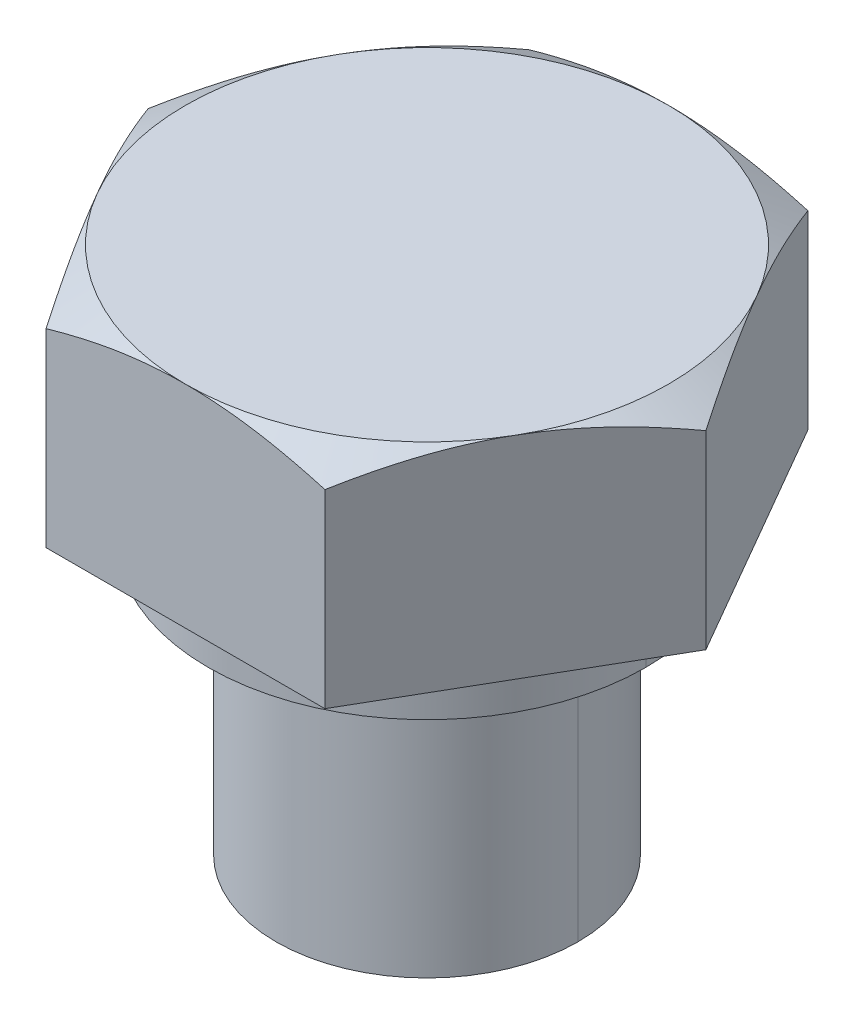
ISO-10303-21;
HEADER;
FILE_DESCRIPTION(('STEP AP214'),'2;1');
FILE_NAME('part.step','',(''),(''),'','','');
FILE_SCHEMA(('AUTOMOTIVE_DESIGN { 1 0 10303 214 1 1 1 1 }'));
ENDSEC;
DATA;
#1=APPLICATION_CONTEXT('core data for automotive mechanical design processes');
#2=APPLICATION_PROTOCOL_DEFINITION('international standard','automotive_design',2000,#1);
#3=PRODUCT_CONTEXT('',#1,'mechanical');
#4=PRODUCT('Part','Part','',(#3));
#5=PRODUCT_RELATED_PRODUCT_CATEGORY('part','',(#4));
#6=PRODUCT_DEFINITION_FORMATION('','',#4);
#7=PRODUCT_DEFINITION_CONTEXT('part definition',#1,'design');
#8=PRODUCT_DEFINITION('design','',#6,#7);
#9=PRODUCT_DEFINITION_SHAPE('','',#8);
#10=(LENGTH_UNIT() NAMED_UNIT(*) SI_UNIT(.MILLI.,.METRE.));
#11=(NAMED_UNIT(*) PLANE_ANGLE_UNIT() SI_UNIT($,.RADIAN.));
#12=(NAMED_UNIT(*) SI_UNIT($,.STERADIAN.) SOLID_ANGLE_UNIT());
#13=UNCERTAINTY_MEASURE_WITH_UNIT(LENGTH_MEASURE(1.E-05),#10,'distance_accuracy_value','');
#14=(GEOMETRIC_REPRESENTATION_CONTEXT(3) GLOBAL_UNCERTAINTY_ASSIGNED_CONTEXT((#13)) GLOBAL_UNIT_ASSIGNED_CONTEXT((#10,
#11,#12)) REPRESENTATION_CONTEXT('',''));
#15=CARTESIAN_POINT('',(0.,0.,0.));
#16=DIRECTION('',(0.,0.,1.));
#17=DIRECTION('',(1.,0.,0.));
#18=AXIS2_PLACEMENT_3D('',#15,#16,#17);
#19=CARTESIAN_POINT('',(-10.,-21.,0.));
#20=DIRECTION('',(0.,1.,0.));
#21=DIRECTION('',(1.,0.,0.));
#22=AXIS2_PLACEMENT_3D('',#19,#20,#21);
#23=PLANE('',#22);
#24=CARTESIAN_POINT('',(0.,-21.,0.));
#25=DIRECTION('',(0.,-1.,0.));
#26=DIRECTION('',(1.,0.,0.));
#27=AXIS2_PLACEMENT_3D('',#24,#25,#26);
#28=CIRCLE('',#27,10.);
#29=CARTESIAN_POINT('',(10.0000000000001,-21.,0.));
#30=VERTEX_POINT('',#29);
#31=CARTESIAN_POINT('',(-10.,-21.,0.));
#32=VERTEX_POINT('',#31);
#33=EDGE_CURVE('E186',#30,#32,#28,.T.);
#34=ORIENTED_EDGE('',*,*,#33,.T.);
#35=CARTESIAN_POINT('',(0.,-21.,0.));
#36=DIRECTION('',(0.,-1.,0.));
#37=DIRECTION('',(1.,0.,0.));
#38=AXIS2_PLACEMENT_3D('',#35,#36,#37);
#39=CIRCLE('',#38,10.);
#40=EDGE_CURVE('E11',#32,#30,#39,.T.);
#41=ORIENTED_EDGE('',*,*,#40,.T.);
#42=EDGE_LOOP('',(#34,#41));
#43=FACE_BOUND('',#42,.T.);
#44=ADVANCED_FACE('F17',(#43),#23,.F.);
#45=CARTESIAN_POINT('',(3.49148133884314E-12,-1000.,0.));
#46=DIRECTION('',(0.,-1.,0.));
#47=DIRECTION('',(1.,0.,0.));
#48=AXIS2_PLACEMENT_3D('',#45,#46,#47);
#49=CYLINDRICAL_SURFACE('',#48,10.);
#50=DIRECTION('',(0.,-1.,0.));
#51=VECTOR('',#50,1.);
#52=CARTESIAN_POINT('',(-9.99999999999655,-1000.,0.));
#53=LINE('',#52,#51);
#54=CARTESIAN_POINT('',(-10.,-4.50000000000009,0.));
#55=VERTEX_POINT('',#54);
#56=EDGE_CURVE('E175',#55,#32,#53,.T.);
#57=ORIENTED_EDGE('',*,*,#56,.F.);
#58=CARTESIAN_POINT('',(0.,-4.50000000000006,0.));
#59=DIRECTION('',(0.,-1.,0.));
#60=DIRECTION('',(1.,0.,0.));
#61=AXIS2_PLACEMENT_3D('',#58,#59,#60);
#62=CIRCLE('',#61,10.);
#63=CARTESIAN_POINT('',(10.,-4.5,0.));
#64=VERTEX_POINT('',#63);
#65=EDGE_CURVE('E28',#55,#64,#62,.T.);
#66=ORIENTED_EDGE('',*,*,#65,.T.);
#67=DIRECTION('',(0.,-1.,0.));
#68=VECTOR('',#67,1.);
#69=CARTESIAN_POINT('',(10.0000000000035,-1000.,0.));
#70=LINE('',#69,#68);
#71=EDGE_CURVE('E172',#64,#30,#70,.T.);
#72=ORIENTED_EDGE('',*,*,#71,.T.);
#73=ORIENTED_EDGE('',*,*,#40,.F.);
#74=EDGE_LOOP('',(#57,#66,#72,#73));
#75=FACE_BOUND('',#74,.T.);
#76=ADVANCED_FACE('F171',(#75),#49,.T.);
#77=CARTESIAN_POINT('',(-8.8,-4.5,0.));
#78=DIRECTION('',(0.,-1.,0.));
#79=DIRECTION('',(0.,0.,-1.));
#80=AXIS2_PLACEMENT_3D('',#77,#78,#79);
#81=PLANE('',#80);
#82=CARTESIAN_POINT('',(0.,-4.50000000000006,0.));
#83=DIRECTION('',(0.,-1.,0.));
#84=DIRECTION('',(1.,0.,0.));
#85=AXIS2_PLACEMENT_3D('',#82,#83,#84);
#86=CIRCLE('',#85,8.8);
#87=CARTESIAN_POINT('',(8.8,-4.5,0.));
#88=VERTEX_POINT('',#87);
#89=CARTESIAN_POINT('',(-8.8,-4.50000000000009,0.));
#90=VERTEX_POINT('',#89);
#91=EDGE_CURVE('E219',#88,#90,#86,.T.);
#92=ORIENTED_EDGE('',*,*,#91,.T.);
#93=CARTESIAN_POINT('',(0.,-4.50000000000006,0.));
#94=DIRECTION('',(0.,-1.,0.));
#95=DIRECTION('',(1.,0.,0.));
#96=AXIS2_PLACEMENT_3D('',#93,#94,#95);
#97=CIRCLE('',#96,8.8);
#98=EDGE_CURVE('E180',#90,#88,#97,.T.);
#99=ORIENTED_EDGE('',*,*,#98,.T.);
#100=EDGE_LOOP('',(#92,#99));
#101=FACE_BOUND('',#100,.T.);
#102=CARTESIAN_POINT('',(0.,-4.50000000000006,0.));
#103=DIRECTION('',(0.,-1.,0.));
#104=DIRECTION('',(1.,0.,0.));
#105=AXIS2_PLACEMENT_3D('',#102,#103,#104);
#106=CIRCLE('',#105,10.);
#107=EDGE_CURVE('E184',#64,#55,#106,.T.);
#108=ORIENTED_EDGE('',*,*,#107,.F.);
#109=ORIENTED_EDGE('',*,*,#65,.F.);
#110=EDGE_LOOP('',(#108,#109));
#111=FACE_BOUND('',#110,.T.);
#112=ADVANCED_FACE('F190',(#101,#111),#81,.F.);
#113=CARTESIAN_POINT('',(3.49148133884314E-12,-1000.,0.));
#114=DIRECTION('',(0.,-1.,0.));
#115=DIRECTION('',(1.,0.,0.));
#116=AXIS2_PLACEMENT_3D('',#113,#114,#115);
#117=CYLINDRICAL_SURFACE('',#116,8.8);
#118=DIRECTION('',(0.,-1.,0.));
#119=VECTOR('',#118,1.);
#120=CARTESIAN_POINT('',(-8.79999999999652,-1000.,0.));
#121=LINE('',#120,#119);
#122=CARTESIAN_POINT('',(-8.8,-3.00000000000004,0.));
#123=VERTEX_POINT('',#122);
#124=EDGE_CURVE('E211',#123,#90,#121,.T.);
#125=ORIENTED_EDGE('',*,*,#124,.F.);
#126=CARTESIAN_POINT('',(0.,-3.,0.));
#127=DIRECTION('',(0.,-1.,0.));
#128=DIRECTION('',(1.,0.,0.));
#129=AXIS2_PLACEMENT_3D('',#126,#127,#128);
#130=CIRCLE('',#129,8.8);
#131=CARTESIAN_POINT('',(8.8,-3.,0.));
#132=VERTEX_POINT('',#131);
#133=EDGE_CURVE('E228',#123,#132,#130,.T.);
#134=ORIENTED_EDGE('',*,*,#133,.T.);
#135=DIRECTION('',(0.,-1.,0.));
#136=VECTOR('',#135,1.);
#137=CARTESIAN_POINT('',(8.80000000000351,-1000.,0.));
#138=LINE('',#137,#136);
#139=EDGE_CURVE('E223',#132,#88,#138,.T.);
#140=ORIENTED_EDGE('',*,*,#139,.T.);
#141=ORIENTED_EDGE('',*,*,#98,.F.);
#142=EDGE_LOOP('',(#125,#134,#140,#141));
#143=FACE_BOUND('',#142,.T.);
#144=ADVANCED_FACE('F955',(#143),#117,.T.);
#145=CARTESIAN_POINT('',(-14.5,-3.,0.));
#146=DIRECTION('',(0.,1.,0.));
#147=DIRECTION('',(1.,0.,0.));
#148=AXIS2_PLACEMENT_3D('',#145,#146,#147);
#149=PLANE('',#148);
#150=CARTESIAN_POINT('',(0.,-3.,0.));
#151=DIRECTION('',(0.,-1.,0.));
#152=DIRECTION('',(1.,0.,0.));
#153=AXIS2_PLACEMENT_3D('',#150,#151,#152);
#154=CIRCLE('',#153,8.8);
#155=EDGE_CURVE('E188',#132,#123,#154,.T.);
#156=ORIENTED_EDGE('',*,*,#155,.F.);
#157=ORIENTED_EDGE('',*,*,#133,.F.);
#158=EDGE_LOOP('',(#156,#157));
#159=FACE_BOUND('',#158,.T.);
#160=CARTESIAN_POINT('',(0.,-3.,0.));
#161=DIRECTION('',(0.,-1.,0.));
#162=DIRECTION('',(1.,0.,0.));
#163=AXIS2_PLACEMENT_3D('',#160,#161,#162);
#164=CIRCLE('',#163,14.5);
#165=CARTESIAN_POINT('',(14.5,-2.99999999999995,0.));
#166=VERTEX_POINT('',#165);
#167=CARTESIAN_POINT('',(-14.5,-3.00000000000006,0.));
#168=VERTEX_POINT('',#167);
#169=EDGE_CURVE('E200',#166,#168,#164,.T.);
#170=ORIENTED_EDGE('',*,*,#169,.T.);
#171=CARTESIAN_POINT('',(0.,-3.,0.));
#172=DIRECTION('',(0.,-1.,0.));
#173=DIRECTION('',(1.,0.,0.));
#174=AXIS2_PLACEMENT_3D('',#171,#172,#173);
#175=CIRCLE('',#174,14.5);
#176=EDGE_CURVE('E231',#168,#166,#175,.T.);
#177=ORIENTED_EDGE('',*,*,#176,.T.);
#178=EDGE_LOOP('',(#170,#177));
#179=FACE_BOUND('',#178,.T.);
#180=ADVANCED_FACE('F947',(#159,#179),#149,.F.);
#181=CARTESIAN_POINT('',(3.49148133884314E-12,-1000.,0.));
#182=DIRECTION('',(0.,-1.,0.));
#183=DIRECTION('',(1.,0.,0.));
#184=AXIS2_PLACEMENT_3D('',#181,#182,#183);
#185=CYLINDRICAL_SURFACE('',#184,14.5);
#186=DIRECTION('',(0.,-1.,0.));
#187=VECTOR('',#186,1.);
#188=CARTESIAN_POINT('',(-14.4999999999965,-1000.,0.));
#189=LINE('',#188,#187);
#190=CARTESIAN_POINT('',(-14.5,0.,0.));
#191=VERTEX_POINT('',#190);
#192=EDGE_CURVE('E204',#191,#168,#189,.T.);
#193=ORIENTED_EDGE('',*,*,#192,.F.);
#194=CARTESIAN_POINT('',(0.,0.,0.));
#195=DIRECTION('',(0.,-1.,0.));
#196=DIRECTION('',(0.,0.,1.));
#197=AXIS2_PLACEMENT_3D('',#194,#195,#196);
#198=CIRCLE('',#197,14.5);
#199=CARTESIAN_POINT('',(14.5,0.,0.));
#200=VERTEX_POINT('',#199);
#201=EDGE_CURVE('E268',#191,#200,#198,.T.);
#202=ORIENTED_EDGE('',*,*,#201,.T.);
#203=DIRECTION('',(0.,-1.,0.));
#204=VECTOR('',#203,1.);
#205=CARTESIAN_POINT('',(14.5000000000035,-1000.,0.));
#206=LINE('',#205,#204);
#207=EDGE_CURVE('E203',#200,#166,#206,.T.);
#208=ORIENTED_EDGE('',*,*,#207,.T.);
#209=ORIENTED_EDGE('',*,*,#176,.F.);
#210=EDGE_LOOP('',(#193,#202,#208,#209));
#211=FACE_BOUND('',#210,.T.);
#212=ADVANCED_FACE('F940',(#211),#185,.T.);
#213=CARTESIAN_POINT('',(0.,14.,0.));
#214=DIRECTION('',(0.,1.,0.));
#215=DIRECTION('',(1.,0.,0.));
#216=AXIS2_PLACEMENT_3D('',#213,#214,#215);
#217=PLANE('',#216);
#218=CARTESIAN_POINT('',(0.,14.,0.));
#219=DIRECTION('',(0.,1.,0.));
#220=DIRECTION('',(0.,0.,1.));
#221=AXIS2_PLACEMENT_3D('',#218,#219,#220);
#222=CIRCLE('',#221,16.);
#223=CARTESIAN_POINT('',(0.,14.,-16.));
#224=VERTEX_POINT('',#223);
#225=CARTESIAN_POINT('',(-13.856406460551,14.,-8.));
#226=VERTEX_POINT('',#225);
#227=EDGE_CURVE('E404',#224,#226,#222,.T.);
#228=ORIENTED_EDGE('',*,*,#227,.T.);
#229=CARTESIAN_POINT('',(0.,14.,0.));
#230=DIRECTION('',(0.,1.,0.));
#231=DIRECTION('',(0.,0.,1.));
#232=AXIS2_PLACEMENT_3D('',#229,#230,#231);
#233=CIRCLE('',#232,16.);
#234=CARTESIAN_POINT('',(-13.856406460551,14.,8.));
#235=VERTEX_POINT('',#234);
#236=EDGE_CURVE('E252',#226,#235,#233,.T.);
#237=ORIENTED_EDGE('',*,*,#236,.T.);
#238=CARTESIAN_POINT('',(0.,14.,0.));
#239=DIRECTION('',(0.,1.,0.));
#240=DIRECTION('',(0.,0.,1.));
#241=AXIS2_PLACEMENT_3D('',#238,#239,#240);
#242=CIRCLE('',#241,16.);
#243=CARTESIAN_POINT('',(0.,14.,16.));
#244=VERTEX_POINT('',#243);
#245=EDGE_CURVE('E511',#235,#244,#242,.T.);
#246=ORIENTED_EDGE('',*,*,#245,.T.);
#247=CARTESIAN_POINT('',(0.,14.,0.));
#248=DIRECTION('',(0.,1.,0.));
#249=DIRECTION('',(0.,0.,1.));
#250=AXIS2_PLACEMENT_3D('',#247,#248,#249);
#251=CIRCLE('',#250,16.);
#252=CARTESIAN_POINT('',(13.856406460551,14.,8.));
#253=VERTEX_POINT('',#252);
#254=EDGE_CURVE('E271',#244,#253,#251,.T.);
#255=ORIENTED_EDGE('',*,*,#254,.T.);
#256=CARTESIAN_POINT('',(0.,14.,0.));
#257=DIRECTION('',(0.,1.,0.));
#258=DIRECTION('',(0.,0.,1.));
#259=AXIS2_PLACEMENT_3D('',#256,#257,#258);
#260=CIRCLE('',#259,16.);
#261=CARTESIAN_POINT('',(13.856406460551,14.,-8.));
#262=VERTEX_POINT('',#261);
#263=EDGE_CURVE('E42',#253,#262,#260,.T.);
#264=ORIENTED_EDGE('',*,*,#263,.T.);
#265=CARTESIAN_POINT('',(0.,14.,0.));
#266=DIRECTION('',(0.,1.,0.));
#267=DIRECTION('',(0.,0.,1.));
#268=AXIS2_PLACEMENT_3D('',#265,#266,#267);
#269=CIRCLE('',#268,16.);
#270=EDGE_CURVE('E413',#262,#224,#269,.T.);
#271=ORIENTED_EDGE('',*,*,#270,.T.);
#272=EDGE_LOOP('',(#228,#237,#246,#255,#264,#271));
#273=FACE_BOUND('',#272,.T.);
#274=ADVANCED_FACE('F325',(#273),#217,.T.);
#275=CARTESIAN_POINT('',(0.,14.,0.));
#276=DIRECTION('',(0.,-1.,0.));
#277=DIRECTION('',(0.,0.,1.));
#278=AXIS2_PLACEMENT_3D('',#275,#276,#277);
#279=CONICAL_SURFACE('',#278,16.,1.0471975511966);
#280=CARTESIAN_POINT('',(-18.475208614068,12.5709376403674,0.));
#281=CARTESIAN_POINT('',(-17.2736739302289,13.2646440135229,-2.08111911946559));
#282=CARTESIAN_POINT('',(-16.1894881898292,13.6151811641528,-3.95898390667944));
#283=CARTESIAN_POINT('',(-14.999271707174,14.,-6.02049932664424));
#284=CARTESIAN_POINT('',(-13.856406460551,14.,-7.99999999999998));
#285=B_SPLINE_CURVE_WITH_KNOTS('',2,(#280,#281,#282,#283,#284),.UNSPECIFIED.,.F.,.F.,(3,2,3),
(0.,0.5,1.),.UNSPECIFIED.);
#286=CARTESIAN_POINT('',(-18.475208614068,12.5709376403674,0.));
#287=VERTEX_POINT('',#286);
#288=EDGE_CURVE('E419',#287,#226,#285,.T.);
#289=ORIENTED_EDGE('',*,*,#288,.F.);
#290=CARTESIAN_POINT('',(-13.856406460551,14.,8.));
#291=CARTESIAN_POINT('',(-14.4407214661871,14.,6.98793672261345));
#292=CARTESIAN_POINT('',(-15.0315803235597,13.9008644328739,5.96453916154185));
#293=CARTESIAN_POINT('',(-15.602960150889,13.8049970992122,4.9748802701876));
#294=CARTESIAN_POINT('',(-16.1924322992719,13.614228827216,3.95388455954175));
#295=CARTESIAN_POINT('',(-17.2749849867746,13.2638870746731,2.0788483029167));
#296=CARTESIAN_POINT('',(-18.475208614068,12.5709376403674,0.));
#297=B_SPLINE_CURVE_WITH_KNOTS('',2,(#290,#291,#292,#293,#294,#295,#296),.UNSPECIFIED.,.F.,.F.,
(3,2,2,3),(0.,0.25,0.5,1.),.UNSPECIFIED.);
#298=EDGE_CURVE('E258',#235,#287,#297,.T.);
#299=ORIENTED_EDGE('',*,*,#298,.F.);
#300=ORIENTED_EDGE('',*,*,#236,.F.);
#301=EDGE_LOOP('',(#289,#299,#300));
#302=FACE_BOUND('',#301,.T.);
#303=ADVANCED_FACE('F392',(#302),#279,.T.);
#304=CARTESIAN_POINT('',(0.,14.,0.));
#305=DIRECTION('',(0.,-1.,0.));
#306=DIRECTION('',(0.,0.,1.));
#307=AXIS2_PLACEMENT_3D('',#304,#305,#306);
#308=CONICAL_SURFACE('',#307,16.,1.0471975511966);
#309=CARTESIAN_POINT('',(-13.856406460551,14.,-7.99999999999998));
#310=CARTESIAN_POINT('',(-13.2720914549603,14.,-9.01206327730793));
#311=CARTESIAN_POINT('',(-12.6812325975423,13.9008644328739,-10.0354608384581));
#312=CARTESIAN_POINT('',(-12.1098527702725,13.8049970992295,-11.0251197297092));
#313=CARTESIAN_POINT('',(-11.5203806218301,13.614228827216,-12.0461154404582));
#314=CARTESIAN_POINT('',(-10.4378279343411,13.2638870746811,-13.9211516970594));
#315=CARTESIAN_POINT('',(-9.237604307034,12.5709376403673,-16.));
#316=B_SPLINE_CURVE_WITH_KNOTS('',2,(#309,#310,#311,#312,#313,#314,#315),.UNSPECIFIED.,.F.,.F.,
(3,2,2,3),(0.,0.25,0.5,1.),.UNSPECIFIED.);
#317=CARTESIAN_POINT('',(-9.237604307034,12.5709376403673,-16.));
#318=VERTEX_POINT('',#317);
#319=EDGE_CURVE('E249',#226,#318,#316,.T.);
#320=ORIENTED_EDGE('',*,*,#319,.F.);
#321=ORIENTED_EDGE('',*,*,#227,.F.);
#322=CARTESIAN_POINT('',(-9.23760430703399,12.5709376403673,-16.));
#323=CARTESIAN_POINT('',(-6.82852054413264,13.2663802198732,-16.));
#324=CARTESIAN_POINT('',(-4.65516688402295,13.6169567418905,-16.));
#325=CARTESIAN_POINT('',(-2.28053990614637,14.,-16.));
#326=CARTESIAN_POINT('',(0.,14.,-16.));
#327=B_SPLINE_CURVE_WITH_KNOTS('',2,(#322,#323,#324,#325,#326),.UNSPECIFIED.,.F.,.F.,(3,2,3),
(0.,0.5,1.),.UNSPECIFIED.);
#328=EDGE_CURVE('E481',#318,#224,#327,.T.);
#329=ORIENTED_EDGE('',*,*,#328,.F.);
#330=EDGE_LOOP('',(#320,#321,#329));
#331=FACE_BOUND('',#330,.T.);
#332=ADVANCED_FACE('F382',(#331),#308,.T.);
#333=CARTESIAN_POINT('',(0.,14.,0.));
#334=DIRECTION('',(0.,-1.,0.));
#335=DIRECTION('',(0.,0.,1.));
#336=AXIS2_PLACEMENT_3D('',#333,#334,#335);
#337=CONICAL_SURFACE('',#336,16.,1.0471975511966);
#338=CARTESIAN_POINT('',(0.,14.,-16.));
#339=CARTESIAN_POINT('',(1.17148055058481,14.,-16.));
#340=CARTESIAN_POINT('',(2.35614356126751,13.9003775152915,-16.));
#341=CARTESIAN_POINT('',(3.50449285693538,13.8038087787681,-16.));
#342=CARTESIAN_POINT('',(4.68948698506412,13.6114024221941,-16.));
#343=CARTESIAN_POINT('',(6.84665600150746,13.2611449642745,-16.));
#344=CARTESIAN_POINT('',(9.23760430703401,12.5709376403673,-16.));
#345=B_SPLINE_CURVE_WITH_KNOTS('',2,(#338,#339,#340,#341,#342,#343,#344),.UNSPECIFIED.,.F.,.F.,
(3,2,2,3),(0.,0.25,0.5,1.),.UNSPECIFIED.);
#346=CARTESIAN_POINT('',(9.23760430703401,12.5709376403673,-16.));
#347=VERTEX_POINT('',#346);
#348=EDGE_CURVE('E243',#224,#347,#345,.T.);
#349=ORIENTED_EDGE('',*,*,#348,.F.);
#350=ORIENTED_EDGE('',*,*,#270,.F.);
#351=CARTESIAN_POINT('',(9.23760430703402,12.5709376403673,-16.));
#352=CARTESIAN_POINT('',(10.439138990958,13.2646440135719,-13.9188808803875));
#353=CARTESIAN_POINT('',(11.5233247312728,13.6151811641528,-12.0410160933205));
#354=CARTESIAN_POINT('',(12.7135412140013,14.,-9.97950067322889));
#355=CARTESIAN_POINT('',(13.856406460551,14.,-8.));
#356=B_SPLINE_CURVE_WITH_KNOTS('',2,(#351,#352,#353,#354,#355),.UNSPECIFIED.,.F.,.F.,(3,2,3),
(0.,0.5,1.),.UNSPECIFIED.);
#357=EDGE_CURVE('E215',#347,#262,#356,.T.);
#358=ORIENTED_EDGE('',*,*,#357,.F.);
#359=EDGE_LOOP('',(#349,#350,#358));
#360=FACE_BOUND('',#359,.T.);
#361=ADVANCED_FACE('F391',(#360),#337,.T.);
#362=CARTESIAN_POINT('',(0.,14.,0.));
#363=DIRECTION('',(0.,-1.,0.));
#364=DIRECTION('',(0.,0.,1.));
#365=AXIS2_PLACEMENT_3D('',#362,#363,#364);
#366=CONICAL_SURFACE('',#365,16.,1.0471975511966);
#367=CARTESIAN_POINT('',(-9.23760430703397,12.5709376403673,16.));
#368=CARTESIAN_POINT('',(-10.439138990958,13.2646440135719,13.9188808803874));
#369=CARTESIAN_POINT('',(-11.5233247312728,13.6151811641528,12.0410160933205));
#370=CARTESIAN_POINT('',(-12.7135412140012,14.,9.97950067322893));
#371=CARTESIAN_POINT('',(-13.856406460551,14.,8.));
#372=B_SPLINE_CURVE_WITH_KNOTS('',2,(#367,#368,#369,#370,#371),.UNSPECIFIED.,.F.,.F.,(3,2,3),
(0.,0.5,1.),.UNSPECIFIED.);
#373=CARTESIAN_POINT('',(-9.237604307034,12.5709376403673,16.));
#374=VERTEX_POINT('',#373);
#375=EDGE_CURVE('E537',#374,#235,#372,.T.);
#376=ORIENTED_EDGE('',*,*,#375,.F.);
#377=CARTESIAN_POINT('',(0.,14.,16.));
#378=CARTESIAN_POINT('',(-2.28006963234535,14.,16.));
#379=CARTESIAN_POINT('',(-4.65516688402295,13.6169567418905,16.));
#380=CARTESIAN_POINT('',(-6.82797568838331,13.2665375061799,16.));
#381=CARTESIAN_POINT('',(-9.237604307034,12.5709376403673,16.));
#382=B_SPLINE_CURVE_WITH_KNOTS('',2,(#377,#378,#379,#380,#381),.UNSPECIFIED.,.F.,.F.,(3,2,3),
(0.,0.5,1.),.UNSPECIFIED.);
#383=EDGE_CURVE('E264',#244,#374,#382,.T.);
#384=ORIENTED_EDGE('',*,*,#383,.F.);
#385=ORIENTED_EDGE('',*,*,#245,.F.);
#386=EDGE_LOOP('',(#376,#384,#385));
#387=FACE_BOUND('',#386,.T.);
#388=ADVANCED_FACE('F324',(#387),#366,.T.);
#389=CARTESIAN_POINT('',(0.,14.,0.));
#390=DIRECTION('',(0.,-1.,0.));
#391=DIRECTION('',(0.,0.,1.));
#392=AXIS2_PLACEMENT_3D('',#389,#390,#391);
#393=CONICAL_SURFACE('',#392,16.,1.0471975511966);
#394=CARTESIAN_POINT('',(13.856406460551,14.,-8.));
#395=CARTESIAN_POINT('',(14.4407214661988,14.,-6.98793672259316));
#396=CARTESIAN_POINT('',(15.0315803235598,13.9008644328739,-5.96453916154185));
#397=CARTESIAN_POINT('',(15.6029601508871,13.8049970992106,-4.97488027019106));
#398=CARTESIAN_POINT('',(16.1924322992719,13.614228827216,-3.95388455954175));
#399=CARTESIAN_POINT('',(17.2749849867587,13.2638870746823,-2.07884830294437));
#400=CARTESIAN_POINT('',(18.475208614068,12.5709376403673,0.));
#401=B_SPLINE_CURVE_WITH_KNOTS('',2,(#394,#395,#396,#397,#398,#399,#400),.UNSPECIFIED.,.F.,.F.,
(3,2,2,3),(0.,0.25,0.5,1.),.UNSPECIFIED.);
#402=CARTESIAN_POINT('',(18.475208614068,12.5709376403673,0.));
#403=VERTEX_POINT('',#402);
#404=EDGE_CURVE('E375',#262,#403,#401,.T.);
#405=ORIENTED_EDGE('',*,*,#404,.F.);
#406=ORIENTED_EDGE('',*,*,#263,.F.);
#407=CARTESIAN_POINT('',(18.475208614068,12.5709376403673,0.));
#408=CARTESIAN_POINT('',(17.2736739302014,13.2646440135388,2.08111911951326));
#409=CARTESIAN_POINT('',(16.1894881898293,13.6151811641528,3.95898390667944));
#410=CARTESIAN_POINT('',(14.9992717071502,14.,6.02049932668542));
#411=CARTESIAN_POINT('',(13.856406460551,14.,7.99999999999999));
#412=B_SPLINE_CURVE_WITH_KNOTS('',2,(#407,#408,#409,#410,#411),.UNSPECIFIED.,.F.,.F.,(3,2,3),
(0.,0.5,1.),.UNSPECIFIED.);
#413=EDGE_CURVE('E308',#403,#253,#412,.T.);
#414=ORIENTED_EDGE('',*,*,#413,.F.);
#415=EDGE_LOOP('',(#405,#406,#414));
#416=FACE_BOUND('',#415,.T.);
#417=ADVANCED_FACE('F315',(#416),#393,.T.);
#418=CARTESIAN_POINT('',(0.,14.,0.));
#419=DIRECTION('',(0.,-1.,0.));
#420=DIRECTION('',(0.,0.,1.));
#421=AXIS2_PLACEMENT_3D('',#418,#419,#420);
#422=CONICAL_SURFACE('',#421,16.,1.0471975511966);
#423=CARTESIAN_POINT('',(9.237604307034,12.5709376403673,16.));
#424=CARTESIAN_POINT('',(6.8472408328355,13.2609761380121,16.));
#425=CARTESIAN_POINT('',(4.68948698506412,13.6114024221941,16.));
#426=CARTESIAN_POINT('',(3.5055767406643,13.8036733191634,16.));
#427=CARTESIAN_POINT('',(2.3561435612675,13.9003775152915,16.));
#428=CARTESIAN_POINT('',(1.17202338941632,14.,16.));
#429=CARTESIAN_POINT('',(0.,14.,16.));
#430=B_SPLINE_CURVE_WITH_KNOTS('',2,(#423,#424,#425,#426,#427,#428,#429),.UNSPECIFIED.,.F.,.F.,
(3,2,2,3),(0.,0.5,0.75,1.),.UNSPECIFIED.);
#431=CARTESIAN_POINT('',(9.23760430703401,12.5709376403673,16.));
#432=VERTEX_POINT('',#431);
#433=EDGE_CURVE('E619',#432,#244,#430,.T.);
#434=ORIENTED_EDGE('',*,*,#433,.F.);
#435=CARTESIAN_POINT('',(13.856406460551,14.,7.99999999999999));
#436=CARTESIAN_POINT('',(13.2720914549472,14.,9.01206327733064));
#437=CARTESIAN_POINT('',(12.6812325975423,13.9008644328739,10.0354608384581));
#438=CARTESIAN_POINT('',(12.1098527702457,13.8049970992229,11.0251197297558));
#439=CARTESIAN_POINT('',(11.5203806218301,13.614228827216,12.0461154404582));
#440=CARTESIAN_POINT('',(10.4378279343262,13.2638870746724,13.9211516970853));
#441=CARTESIAN_POINT('',(9.23760430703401,12.5709376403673,16.));
#442=B_SPLINE_CURVE_WITH_KNOTS('',2,(#435,#436,#437,#438,#439,#440,#441),.UNSPECIFIED.,.F.,.F.,
(3,2,2,3),(0.,0.25,0.5,1.),.UNSPECIFIED.);
#443=EDGE_CURVE('E53',#253,#432,#442,.T.);
#444=ORIENTED_EDGE('',*,*,#443,.F.);
#445=ORIENTED_EDGE('',*,*,#254,.F.);
#446=EDGE_LOOP('',(#434,#444,#445));
#447=FACE_BOUND('',#446,.T.);
#448=ADVANCED_FACE('F292',(#447),#422,.T.);
#449=CARTESIAN_POINT('',(0.,0.,0.));
#450=DIRECTION('',(0.,1.,0.));
#451=DIRECTION('',(1.,0.,0.));
#452=AXIS2_PLACEMENT_3D('',#449,#450,#451);
#453=PLANE('',#452);
#454=CARTESIAN_POINT('',(0.,0.,0.));
#455=DIRECTION('',(0.,-1.,0.));
#456=DIRECTION('',(0.,0.,1.));
#457=AXIS2_PLACEMENT_3D('',#454,#455,#456);
#458=CIRCLE('',#457,14.5);
#459=EDGE_CURVE('E227',#200,#191,#458,.T.);
#460=ORIENTED_EDGE('',*,*,#459,.F.);
#461=ORIENTED_EDGE('',*,*,#201,.F.);
#462=EDGE_LOOP('',(#460,#461));
#463=FACE_BOUND('',#462,.T.);
#464=DIRECTION('',(-0.5,0.,-0.866025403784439));
#465=VECTOR('',#464,1.);
#466=CARTESIAN_POINT('',(18.475208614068,0.,0.));
#467=LINE('',#466,#465);
#468=CARTESIAN_POINT('',(18.475208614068,0.,0.));
#469=VERTEX_POINT('',#468);
#470=CARTESIAN_POINT('',(9.23760430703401,0.,-16.));
#471=VERTEX_POINT('',#470);
#472=EDGE_CURVE('E491',#469,#471,#467,.T.);
#473=ORIENTED_EDGE('',*,*,#472,.F.);
#474=DIRECTION('',(0.5,0.,-0.866025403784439));
#475=VECTOR('',#474,1.);
#476=CARTESIAN_POINT('',(9.23760430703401,0.,16.));
#477=LINE('',#476,#475);
#478=CARTESIAN_POINT('',(9.23760430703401,0.,16.));
#479=VERTEX_POINT('',#478);
#480=EDGE_CURVE('E265',#479,#469,#477,.T.);
#481=ORIENTED_EDGE('',*,*,#480,.F.);
#482=DIRECTION('',(1.,0.,0.));
#483=VECTOR('',#482,1.);
#484=CARTESIAN_POINT('',(-9.237604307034,0.,16.));
#485=LINE('',#484,#483);
#486=CARTESIAN_POINT('',(-9.237604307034,0.,16.));
#487=VERTEX_POINT('',#486);
#488=EDGE_CURVE('E259',#487,#479,#485,.T.);
#489=ORIENTED_EDGE('',*,*,#488,.F.);
#490=DIRECTION('',(0.5,0.,0.866025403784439));
#491=VECTOR('',#490,1.);
#492=CARTESIAN_POINT('',(-18.475208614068,0.,0.));
#493=LINE('',#492,#491);
#494=CARTESIAN_POINT('',(-18.475208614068,0.,0.));
#495=VERTEX_POINT('',#494);
#496=EDGE_CURVE('E253',#495,#487,#493,.T.);
#497=ORIENTED_EDGE('',*,*,#496,.F.);
#498=DIRECTION('',(-0.5,0.,0.866025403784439));
#499=VECTOR('',#498,1.);
#500=CARTESIAN_POINT('',(-9.237604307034,0.,-16.));
#501=LINE('',#500,#499);
#502=CARTESIAN_POINT('',(-9.237604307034,0.,-16.));
#503=VERTEX_POINT('',#502);
#504=EDGE_CURVE('E244',#503,#495,#501,.T.);
#505=ORIENTED_EDGE('',*,*,#504,.F.);
#506=DIRECTION('',(-1.,0.,0.));
#507=VECTOR('',#506,1.);
#508=CARTESIAN_POINT('',(9.23760430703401,0.,-16.));
#509=LINE('',#508,#507);
#510=EDGE_CURVE('E238',#471,#503,#509,.T.);
#511=ORIENTED_EDGE('',*,*,#510,.F.);
#512=EDGE_LOOP('',(#473,#481,#489,#497,#505,#511));
#513=FACE_BOUND('',#512,.T.);
#514=ADVANCED_FACE('F290',(#463,#513),#453,.F.);
#515=CARTESIAN_POINT('',(9.23760430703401,14.,16.));
#516=DIRECTION('',(-0.866025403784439,0.,-0.5));
#517=DIRECTION('',(-0.5,0.,0.866025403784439));
#518=AXIS2_PLACEMENT_3D('',#515,#516,#517);
#519=PLANE('',#518);
#520=ORIENTED_EDGE('',*,*,#413,.T.);
#521=ORIENTED_EDGE('',*,*,#443,.T.);
#522=DIRECTION('',(0.,-1.,0.));
#523=VECTOR('',#522,1.);
#524=CARTESIAN_POINT('',(9.23760430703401,14.,16.));
#525=LINE('',#524,#523);
#526=EDGE_CURVE('E263',#432,#479,#525,.T.);
#527=ORIENTED_EDGE('',*,*,#526,.T.);
#528=ORIENTED_EDGE('',*,*,#480,.T.);
#529=DIRECTION('',(0.,-1.,0.));
#530=VECTOR('',#529,1.);
#531=CARTESIAN_POINT('',(18.475208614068,14.,0.));
#532=LINE('',#531,#530);
#533=EDGE_CURVE('E313',#403,#469,#532,.T.);
#534=ORIENTED_EDGE('',*,*,#533,.F.);
#535=EDGE_LOOP('',(#520,#521,#527,#528,#534));
#536=FACE_BOUND('',#535,.T.);
#537=ADVANCED_FACE('F279',(#536),#519,.F.);
#538=CARTESIAN_POINT('',(-9.237604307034,14.,16.));
#539=DIRECTION('',(0.,0.,-1.));
#540=DIRECTION('',(0.,-1.,0.));
#541=AXIS2_PLACEMENT_3D('',#538,#539,#540);
#542=PLANE('',#541);
#543=ORIENTED_EDGE('',*,*,#383,.T.);
#544=DIRECTION('',(0.,-1.,0.));
#545=VECTOR('',#544,1.);
#546=CARTESIAN_POINT('',(-9.237604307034,14.,16.));
#547=LINE('',#546,#545);
#548=EDGE_CURVE('E257',#374,#487,#547,.T.);
#549=ORIENTED_EDGE('',*,*,#548,.T.);
#550=ORIENTED_EDGE('',*,*,#488,.T.);
#551=ORIENTED_EDGE('',*,*,#526,.F.);
#552=ORIENTED_EDGE('',*,*,#433,.T.);
#553=EDGE_LOOP('',(#543,#549,#550,#551,#552));
#554=FACE_BOUND('',#553,.T.);
#555=ADVANCED_FACE('F289',(#554),#542,.F.);
#556=CARTESIAN_POINT('',(-18.475208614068,14.,0.));
#557=DIRECTION('',(0.866025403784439,0.,-0.5));
#558=DIRECTION('',(0.,-1.,0.));
#559=AXIS2_PLACEMENT_3D('',#556,#557,#558);
#560=PLANE('',#559);
#561=ORIENTED_EDGE('',*,*,#298,.T.);
#562=DIRECTION('',(0.,-1.,0.));
#563=VECTOR('',#562,1.);
#564=CARTESIAN_POINT('',(-18.475208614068,14.,0.));
#565=LINE('',#564,#563);
#566=EDGE_CURVE('E248',#287,#495,#565,.T.);
#567=ORIENTED_EDGE('',*,*,#566,.T.);
#568=ORIENTED_EDGE('',*,*,#496,.T.);
#569=ORIENTED_EDGE('',*,*,#548,.F.);
#570=ORIENTED_EDGE('',*,*,#375,.T.);
#571=EDGE_LOOP('',(#561,#567,#568,#569,#570));
#572=FACE_BOUND('',#571,.T.);
#573=ADVANCED_FACE('F532',(#572),#560,.F.);
#574=CARTESIAN_POINT('',(-9.237604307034,14.,-16.));
#575=DIRECTION('',(0.866025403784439,0.,0.5));
#576=DIRECTION('',(0.,-1.,0.));
#577=AXIS2_PLACEMENT_3D('',#574,#575,#576);
#578=PLANE('',#577);
#579=ORIENTED_EDGE('',*,*,#288,.T.);
#580=ORIENTED_EDGE('',*,*,#319,.T.);
#581=DIRECTION('',(0.,-1.,0.));
#582=VECTOR('',#581,1.);
#583=CARTESIAN_POINT('',(-9.237604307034,14.,-16.));
#584=LINE('',#583,#582);
#585=EDGE_CURVE('E242',#318,#503,#584,.T.);
#586=ORIENTED_EDGE('',*,*,#585,.T.);
#587=ORIENTED_EDGE('',*,*,#504,.T.);
#588=ORIENTED_EDGE('',*,*,#566,.F.);
#589=EDGE_LOOP('',(#579,#580,#586,#587,#588));
#590=FACE_BOUND('',#589,.T.);
#591=ADVANCED_FACE('F360',(#590),#578,.F.);
#592=CARTESIAN_POINT('',(9.23760430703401,14.,-16.));
#593=DIRECTION('',(0.,0.,1.));
#594=DIRECTION('',(1.,0.,0.));
#595=AXIS2_PLACEMENT_3D('',#592,#593,#594);
#596=PLANE('',#595);
#597=ORIENTED_EDGE('',*,*,#328,.T.);
#598=ORIENTED_EDGE('',*,*,#348,.T.);
#599=DIRECTION('',(0.,-1.,0.));
#600=VECTOR('',#599,1.);
#601=CARTESIAN_POINT('',(9.23760430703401,14.,-16.));
#602=LINE('',#601,#600);
#603=EDGE_CURVE('E486',#347,#471,#602,.T.);
#604=ORIENTED_EDGE('',*,*,#603,.T.);
#605=ORIENTED_EDGE('',*,*,#510,.T.);
#606=ORIENTED_EDGE('',*,*,#585,.F.);
#607=EDGE_LOOP('',(#597,#598,#604,#605,#606));
#608=FACE_BOUND('',#607,.T.);
#609=ADVANCED_FACE('F359',(#608),#596,.F.);
#610=CARTESIAN_POINT('',(18.475208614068,14.,0.));
#611=DIRECTION('',(-0.866025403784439,0.,0.5));
#612=DIRECTION('',(0.,1.,0.));
#613=AXIS2_PLACEMENT_3D('',#610,#611,#612);
#614=PLANE('',#613);
#615=ORIENTED_EDGE('',*,*,#357,.T.);
#616=ORIENTED_EDGE('',*,*,#404,.T.);
#617=ORIENTED_EDGE('',*,*,#533,.T.);
#618=ORIENTED_EDGE('',*,*,#472,.T.);
#619=ORIENTED_EDGE('',*,*,#603,.F.);
#620=EDGE_LOOP('',(#615,#616,#617,#618,#619));
#621=FACE_BOUND('',#620,.T.);
#622=ADVANCED_FACE('F348',(#621),#614,.F.);
#623=CARTESIAN_POINT('',(3.49148133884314E-12,-1000.,0.));
#624=DIRECTION('',(0.,-1.,0.));
#625=DIRECTION('',(1.,0.,0.));
#626=AXIS2_PLACEMENT_3D('',#623,#624,#625);
#627=CYLINDRICAL_SURFACE('',#626,14.5);
#628=ORIENTED_EDGE('',*,*,#459,.T.);
#629=ORIENTED_EDGE('',*,*,#192,.T.);
#630=ORIENTED_EDGE('',*,*,#169,.F.);
#631=ORIENTED_EDGE('',*,*,#207,.F.);
#632=EDGE_LOOP('',(#628,#629,#630,#631));
#633=FACE_BOUND('',#632,.T.);
#634=ADVANCED_FACE('F358',(#633),#627,.T.);
#635=CARTESIAN_POINT('',(3.49148133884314E-12,-1000.,0.));
#636=DIRECTION('',(0.,-1.,0.));
#637=DIRECTION('',(1.,0.,0.));
#638=AXIS2_PLACEMENT_3D('',#635,#636,#637);
#639=CYLINDRICAL_SURFACE('',#638,8.8);
#640=ORIENTED_EDGE('',*,*,#155,.T.);
#641=ORIENTED_EDGE('',*,*,#124,.T.);
#642=ORIENTED_EDGE('',*,*,#91,.F.);
#643=ORIENTED_EDGE('',*,*,#139,.F.);
#644=EDGE_LOOP('',(#640,#641,#642,#643));
#645=FACE_BOUND('',#644,.T.);
#646=ADVANCED_FACE('F552',(#645),#639,.T.);
#647=CARTESIAN_POINT('',(3.49148133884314E-12,-1000.,0.));
#648=DIRECTION('',(0.,-1.,0.));
#649=DIRECTION('',(1.,0.,0.));
#650=AXIS2_PLACEMENT_3D('',#647,#648,#649);
#651=CYLINDRICAL_SURFACE('',#650,10.);
#652=ORIENTED_EDGE('',*,*,#107,.T.);
#653=ORIENTED_EDGE('',*,*,#56,.T.);
#654=ORIENTED_EDGE('',*,*,#33,.F.);
#655=ORIENTED_EDGE('',*,*,#71,.F.);
#656=EDGE_LOOP('',(#652,#653,#654,#655));
#657=FACE_BOUND('',#656,.T.);
#658=ADVANCED_FACE('F183',(#657),#651,.T.);
#659=CLOSED_SHELL('',(#44,#76,#112,#144,#180,#212,#274,#303,#332,#361,#388,#417,#448,#514,#537,
#555,#573,#591,#609,#622,#634,#646,#658));
#660=MANIFOLD_SOLID_BREP('B1',#659);
#661=ADVANCED_BREP_SHAPE_REPRESENTATION('',(#18,#660),#14);
#662=SHAPE_DEFINITION_REPRESENTATION(#9,#661);
ENDSEC;
END-ISO-10303-21;
